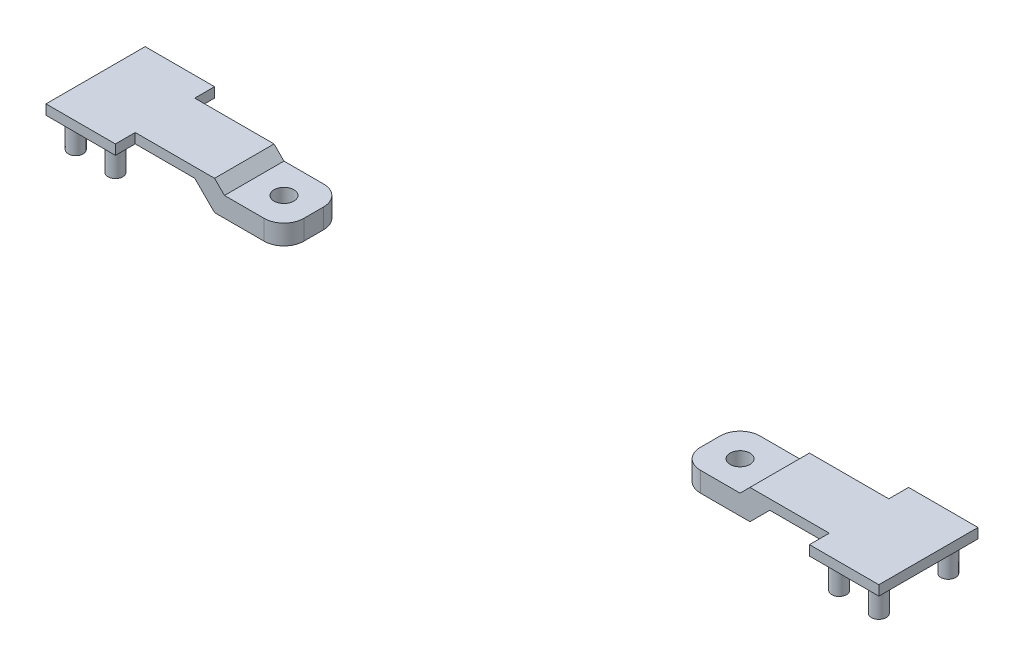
ISO-10303-21;
HEADER;
FILE_DESCRIPTION(('STEP AP214'),'2;1');
FILE_NAME('part.step','',(''),(''),'','','');
FILE_SCHEMA(('AUTOMOTIVE_DESIGN { 1 0 10303 214 1 1 1 1 }'));
ENDSEC;
DATA;
#1=APPLICATION_CONTEXT('core data for automotive mechanical design processes');
#2=APPLICATION_PROTOCOL_DEFINITION('international standard','automotive_design',2000,#1);
#3=PRODUCT_CONTEXT('',#1,'mechanical');
#4=PRODUCT('Part','Part','',(#3));
#5=PRODUCT_RELATED_PRODUCT_CATEGORY('part','',(#4));
#6=PRODUCT_DEFINITION_FORMATION('','',#4);
#7=PRODUCT_DEFINITION_CONTEXT('part definition',#1,'design');
#8=PRODUCT_DEFINITION('design','',#6,#7);
#9=PRODUCT_DEFINITION_SHAPE('','',#8);
#10=(LENGTH_UNIT() NAMED_UNIT(*) SI_UNIT(.MILLI.,.METRE.));
#11=(NAMED_UNIT(*) PLANE_ANGLE_UNIT() SI_UNIT($,.RADIAN.));
#12=(NAMED_UNIT(*) SI_UNIT($,.STERADIAN.) SOLID_ANGLE_UNIT());
#13=UNCERTAINTY_MEASURE_WITH_UNIT(LENGTH_MEASURE(1.E-05),#10,'distance_accuracy_value','');
#14=(GEOMETRIC_REPRESENTATION_CONTEXT(3) GLOBAL_UNCERTAINTY_ASSIGNED_CONTEXT((#13)) GLOBAL_UNIT_ASSIGNED_CONTEXT((#10,
#11,#12)) REPRESENTATION_CONTEXT('',''));
#15=CARTESIAN_POINT('',(0.,0.,0.));
#16=DIRECTION('',(0.,0.,1.));
#17=DIRECTION('',(1.,0.,0.));
#18=AXIS2_PLACEMENT_3D('',#15,#16,#17);
#19=CARTESIAN_POINT('',(-350.,10.,0.));
#20=DIRECTION('',(-1.,0.,0.));
#21=DIRECTION('',(0.,0.,1.));
#22=AXIS2_PLACEMENT_3D('',#19,#20,#21);
#23=PLANE('',#22);
#24=DIRECTION('',(0.,-1.,0.));
#25=VECTOR('',#24,1.);
#26=CARTESIAN_POINT('',(-350.,0.,30.));
#27=LINE('',#26,#25);
#28=CARTESIAN_POINT('',(-350.,10.,30.));
#29=VERTEX_POINT('',#28);
#30=CARTESIAN_POINT('',(-350.,0.,30.));
#31=VERTEX_POINT('',#30);
#32=EDGE_CURVE('E665',#29,#31,#27,.T.);
#33=ORIENTED_EDGE('',*,*,#32,.F.);
#34=DIRECTION('',(0.,0.,-1.));
#35=VECTOR('',#34,1.);
#36=CARTESIAN_POINT('',(-350.,10.,0.));
#37=LINE('',#36,#35);
#38=CARTESIAN_POINT('',(-350.,10.,50.0000000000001));
#39=VERTEX_POINT('',#38);
#40=EDGE_CURVE('E188',#39,#29,#37,.T.);
#41=ORIENTED_EDGE('',*,*,#40,.F.);
#42=DIRECTION('',(0.,-1.,0.));
#43=VECTOR('',#42,1.);
#44=CARTESIAN_POINT('',(-350.,10.,50.0000000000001));
#45=LINE('',#44,#43);
#46=CARTESIAN_POINT('',(-350.,0.,50.0000000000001));
#47=VERTEX_POINT('',#46);
#48=EDGE_CURVE('E231',#39,#47,#45,.T.);
#49=ORIENTED_EDGE('',*,*,#48,.T.);
#50=DIRECTION('',(0.,0.,-1.));
#51=VECTOR('',#50,1.);
#52=CARTESIAN_POINT('',(-350.,0.,0.));
#53=LINE('',#52,#51);
#54=EDGE_CURVE('E213',#47,#31,#53,.T.);
#55=ORIENTED_EDGE('',*,*,#54,.T.);
#56=EDGE_LOOP('',(#33,#41,#49,#55));
#57=FACE_BOUND('',#56,.T.);
#58=ADVANCED_FACE('F55',(#57),#23,.F.);
#59=CARTESIAN_POINT('',(0.,10.,50.0000000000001));
#60=DIRECTION('',(0.,0.,1.));
#61=DIRECTION('',(1.,0.,0.));
#62=AXIS2_PLACEMENT_3D('',#59,#60,#61);
#63=PLANE('',#62);
#64=DIRECTION('',(-1.,0.,0.));
#65=VECTOR('',#64,1.);
#66=CARTESIAN_POINT('',(0.,0.,50.0000000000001));
#67=LINE('',#66,#65);
#68=CARTESIAN_POINT('',(-420.,0.,50.0000000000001));
#69=VERTEX_POINT('',#68);
#70=EDGE_CURVE('E207',#47,#69,#67,.T.);
#71=ORIENTED_EDGE('',*,*,#70,.F.);
#72=ORIENTED_EDGE('',*,*,#48,.F.);
#73=DIRECTION('',(-1.,0.,0.));
#74=VECTOR('',#73,1.);
#75=CARTESIAN_POINT('',(0.,10.,50.0000000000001));
#76=LINE('',#75,#74);
#77=CARTESIAN_POINT('',(-420.,10.,50.0000000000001));
#78=VERTEX_POINT('',#77);
#79=EDGE_CURVE('E189',#39,#78,#76,.T.);
#80=ORIENTED_EDGE('',*,*,#79,.T.);
#81=DIRECTION('',(0.,-1.,0.));
#82=VECTOR('',#81,1.);
#83=CARTESIAN_POINT('',(-420.,10.,50.0000000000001));
#84=LINE('',#83,#82);
#85=EDGE_CURVE('E206',#78,#69,#84,.T.);
#86=ORIENTED_EDGE('',*,*,#85,.T.);
#87=EDGE_LOOP('',(#71,#72,#80,#86));
#88=FACE_BOUND('',#87,.T.);
#89=ADVANCED_FACE('F348',(#88),#63,.T.);
#90=CARTESIAN_POINT('',(-350.,10.,-30.));
#91=VERTEX_POINT('',#90);
#92=CARTESIAN_POINT('',(-350.,10.,-49.9999999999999));
#93=VERTEX_POINT('',#92);
#94=EDGE_CURVE('E163',#91,#93,#37,.T.);
#95=ORIENTED_EDGE('',*,*,#94,.F.);
#96=DIRECTION('',(0.,-1.,0.));
#97=VECTOR('',#96,1.);
#98=CARTESIAN_POINT('',(-350.,0.,-30.));
#99=LINE('',#98,#97);
#100=CARTESIAN_POINT('',(-350.,0.,-30.));
#101=VERTEX_POINT('',#100);
#102=EDGE_CURVE('E170',#91,#101,#99,.T.);
#103=ORIENTED_EDGE('',*,*,#102,.T.);
#104=CARTESIAN_POINT('',(-350.,0.,-49.9999999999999));
#105=VERTEX_POINT('',#104);
#106=EDGE_CURVE('E211',#101,#105,#53,.T.);
#107=ORIENTED_EDGE('',*,*,#106,.T.);
#108=DIRECTION('',(0.,-1.,0.));
#109=VECTOR('',#108,1.);
#110=CARTESIAN_POINT('',(-350.,10.,-49.9999999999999));
#111=LINE('',#110,#109);
#112=EDGE_CURVE('E185',#93,#105,#111,.T.);
#113=ORIENTED_EDGE('',*,*,#112,.F.);
#114=EDGE_LOOP('',(#95,#103,#107,#113));
#115=FACE_BOUND('',#114,.T.);
#116=ADVANCED_FACE('F183',(#115),#23,.F.);
#117=CARTESIAN_POINT('',(0.,10.,-49.9999999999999));
#118=DIRECTION('',(0.,0.,1.));
#119=DIRECTION('',(1.,0.,0.));
#120=AXIS2_PLACEMENT_3D('',#117,#118,#119);
#121=PLANE('',#120);
#122=DIRECTION('',(-1.,0.,0.));
#123=VECTOR('',#122,1.);
#124=CARTESIAN_POINT('',(0.,0.,-49.9999999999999));
#125=LINE('',#124,#123);
#126=CARTESIAN_POINT('',(-420.,0.,-49.9999999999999));
#127=VERTEX_POINT('',#126);
#128=EDGE_CURVE('E217',#105,#127,#125,.T.);
#129=ORIENTED_EDGE('',*,*,#128,.T.);
#130=DIRECTION('',(0.,-1.,0.));
#131=VECTOR('',#130,1.);
#132=CARTESIAN_POINT('',(-420.,10.,-49.9999999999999));
#133=LINE('',#132,#131);
#134=CARTESIAN_POINT('',(-420.,10.,-49.9999999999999));
#135=VERTEX_POINT('',#134);
#136=EDGE_CURVE('E226',#135,#127,#133,.T.);
#137=ORIENTED_EDGE('',*,*,#136,.F.);
#138=DIRECTION('',(-1.,0.,0.));
#139=VECTOR('',#138,1.);
#140=CARTESIAN_POINT('',(0.,10.,-49.9999999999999));
#141=LINE('',#140,#139);
#142=EDGE_CURVE('E194',#93,#135,#141,.T.);
#143=ORIENTED_EDGE('',*,*,#142,.F.);
#144=ORIENTED_EDGE('',*,*,#112,.T.);
#145=EDGE_LOOP('',(#129,#137,#143,#144));
#146=FACE_BOUND('',#145,.T.);
#147=ADVANCED_FACE('F359',(#146),#121,.F.);
#148=CARTESIAN_POINT('',(-420.,10.,0.));
#149=DIRECTION('',(-1.,0.,0.));
#150=DIRECTION('',(0.,0.,1.));
#151=AXIS2_PLACEMENT_3D('',#148,#149,#150);
#152=PLANE('',#151);
#153=DIRECTION('',(0.,0.,-1.));
#154=VECTOR('',#153,1.);
#155=CARTESIAN_POINT('',(-420.,0.,0.));
#156=LINE('',#155,#154);
#157=EDGE_CURVE('E196',#69,#127,#156,.T.);
#158=ORIENTED_EDGE('',*,*,#157,.F.);
#159=ORIENTED_EDGE('',*,*,#85,.F.);
#160=DIRECTION('',(0.,0.,-1.));
#161=VECTOR('',#160,1.);
#162=CARTESIAN_POINT('',(-420.,10.,0.));
#163=LINE('',#162,#161);
#164=EDGE_CURVE('E202',#78,#135,#163,.T.);
#165=ORIENTED_EDGE('',*,*,#164,.T.);
#166=ORIENTED_EDGE('',*,*,#136,.T.);
#167=EDGE_LOOP('',(#158,#159,#165,#166));
#168=FACE_BOUND('',#167,.T.);
#169=ADVANCED_FACE('F363',(#168),#152,.T.);
#170=CARTESIAN_POINT('',(0.,10.,0.));
#171=DIRECTION('',(0.,1.,0.));
#172=DIRECTION('',(0.,0.,1.));
#173=AXIS2_PLACEMENT_3D('',#170,#171,#172);
#174=PLANE('',#173);
#175=ORIENTED_EDGE('',*,*,#79,.F.);
#176=ORIENTED_EDGE('',*,*,#40,.T.);
#177=DIRECTION('',(1.,0.,0.));
#178=VECTOR('',#177,1.);
#179=CARTESIAN_POINT('',(0.,10.,30.));
#180=LINE('',#179,#178);
#181=CARTESIAN_POINT('',(-270.,10.,30.));
#182=VERTEX_POINT('',#181);
#183=EDGE_CURVE('E239',#29,#182,#180,.T.);
#184=ORIENTED_EDGE('',*,*,#183,.T.);
#185=DIRECTION('',(0.,0.,1.));
#186=VECTOR('',#185,1.);
#187=CARTESIAN_POINT('',(-270.,10.,-30.));
#188=LINE('',#187,#186);
#189=CARTESIAN_POINT('',(-270.,10.,-30.));
#190=VERTEX_POINT('',#189);
#191=EDGE_CURVE('E167',#190,#182,#188,.T.);
#192=ORIENTED_EDGE('',*,*,#191,.F.);
#193=DIRECTION('',(1.,0.,0.));
#194=VECTOR('',#193,1.);
#195=CARTESIAN_POINT('',(0.,10.,-30.));
#196=LINE('',#195,#194);
#197=EDGE_CURVE('E158',#91,#190,#196,.T.);
#198=ORIENTED_EDGE('',*,*,#197,.F.);
#199=ORIENTED_EDGE('',*,*,#94,.T.);
#200=ORIENTED_EDGE('',*,*,#142,.T.);
#201=ORIENTED_EDGE('',*,*,#164,.F.);
#202=EDGE_LOOP('',(#175,#176,#184,#192,#198,#199,#200,#201));
#203=FACE_BOUND('',#202,.T.);
#204=ADVANCED_FACE('F161',(#203),#174,.T.);
#205=CARTESIAN_POINT('',(0.,0.,0.));
#206=DIRECTION('',(0.,1.,0.));
#207=DIRECTION('',(0.,0.,1.));
#208=AXIS2_PLACEMENT_3D('',#205,#206,#207);
#209=PLANE('',#208);
#210=CARTESIAN_POINT('',(-405.,0.,-35.));
#211=DIRECTION('',(0.,1.,0.));
#212=DIRECTION('',(0.,0.,1.));
#213=AXIS2_PLACEMENT_3D('',#210,#211,#212);
#214=CIRCLE('',#213,7.50000000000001);
#215=CARTESIAN_POINT('',(-405.,0.,-27.4999999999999));
#216=VERTEX_POINT('',#215);
#217=EDGE_CURVE('E303',#216,#216,#214,.T.);
#218=ORIENTED_EDGE('',*,*,#217,.T.);
#219=EDGE_LOOP('',(#218));
#220=FACE_BOUND('',#219,.T.);
#221=CARTESIAN_POINT('',(-365.,0.,-35.));
#222=DIRECTION('',(0.,1.,0.));
#223=DIRECTION('',(0.,0.,1.));
#224=AXIS2_PLACEMENT_3D('',#221,#222,#223);
#225=CIRCLE('',#224,7.50000000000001);
#226=CARTESIAN_POINT('',(-365.,0.,-27.5));
#227=VERTEX_POINT('',#226);
#228=EDGE_CURVE('E302',#227,#227,#225,.T.);
#229=ORIENTED_EDGE('',*,*,#228,.T.);
#230=EDGE_LOOP('',(#229));
#231=FACE_BOUND('',#230,.T.);
#232=CARTESIAN_POINT('',(-365.,0.,35.));
#233=DIRECTION('',(0.,1.,0.));
#234=DIRECTION('',(0.,0.,1.));
#235=AXIS2_PLACEMENT_3D('',#232,#233,#234);
#236=CIRCLE('',#235,7.50000000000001);
#237=CARTESIAN_POINT('',(-365.,0.,42.5000000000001));
#238=VERTEX_POINT('',#237);
#239=EDGE_CURVE('E311',#238,#238,#236,.T.);
#240=ORIENTED_EDGE('',*,*,#239,.T.);
#241=EDGE_LOOP('',(#240));
#242=FACE_BOUND('',#241,.T.);
#243=CARTESIAN_POINT('',(-405.,0.,35.));
#244=DIRECTION('',(0.,1.,0.));
#245=DIRECTION('',(0.,0.,1.));
#246=AXIS2_PLACEMENT_3D('',#243,#244,#245);
#247=CIRCLE('',#246,7.50000000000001);
#248=CARTESIAN_POINT('',(-405.,0.,42.5000000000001));
#249=VERTEX_POINT('',#248);
#250=EDGE_CURVE('E319',#249,#249,#247,.T.);
#251=ORIENTED_EDGE('',*,*,#250,.T.);
#252=EDGE_LOOP('',(#251));
#253=FACE_BOUND('',#252,.T.);
#254=ORIENTED_EDGE('',*,*,#70,.T.);
#255=ORIENTED_EDGE('',*,*,#157,.T.);
#256=ORIENTED_EDGE('',*,*,#128,.F.);
#257=ORIENTED_EDGE('',*,*,#106,.F.);
#258=DIRECTION('',(1.,0.,0.));
#259=VECTOR('',#258,1.);
#260=CARTESIAN_POINT('',(0.,0.,-30.));
#261=LINE('',#260,#259);
#262=CARTESIAN_POINT('',(-290.,0.,-30.));
#263=VERTEX_POINT('',#262);
#264=EDGE_CURVE('E178',#101,#263,#261,.T.);
#265=ORIENTED_EDGE('',*,*,#264,.T.);
#266=DIRECTION('',(0.,0.,1.));
#267=VECTOR('',#266,1.);
#268=CARTESIAN_POINT('',(-290.,0.,-30.));
#269=LINE('',#268,#267);
#270=CARTESIAN_POINT('',(-290.,0.,30.));
#271=VERTEX_POINT('',#270);
#272=EDGE_CURVE('E292',#263,#271,#269,.T.);
#273=ORIENTED_EDGE('',*,*,#272,.T.);
#274=DIRECTION('',(1.,0.,0.));
#275=VECTOR('',#274,1.);
#276=CARTESIAN_POINT('',(0.,0.,30.));
#277=LINE('',#276,#275);
#278=EDGE_CURVE('E654',#31,#271,#277,.T.);
#279=ORIENTED_EDGE('',*,*,#278,.F.);
#280=ORIENTED_EDGE('',*,*,#54,.F.);
#281=EDGE_LOOP('',(#254,#255,#256,#257,#265,#273,#279,#280));
#282=FACE_BOUND('',#281,.T.);
#283=ADVANCED_FACE('F329',(#220,#231,#242,#253,#282),#209,.F.);
#284=CARTESIAN_POINT('',(-405.,-30.,35.));
#285=DIRECTION('',(0.,1.,0.));
#286=DIRECTION('',(0.,0.,1.));
#287=AXIS2_PLACEMENT_3D('',#284,#285,#286);
#288=CYLINDRICAL_SURFACE('',#287,7.50000000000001);
#289=CARTESIAN_POINT('',(-405.,-30.,35.));
#290=DIRECTION('',(0.,1.,0.));
#291=DIRECTION('',(0.,0.,1.));
#292=AXIS2_PLACEMENT_3D('',#289,#290,#291);
#293=CIRCLE('',#292,7.50000000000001);
#294=CARTESIAN_POINT('',(-405.,-30.,42.5000000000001));
#295=VERTEX_POINT('',#294);
#296=EDGE_CURVE('E212',#295,#295,#293,.T.);
#297=ORIENTED_EDGE('',*,*,#296,.T.);
#298=EDGE_LOOP('',(#297));
#299=FACE_BOUND('',#298,.T.);
#300=ORIENTED_EDGE('',*,*,#250,.F.);
#301=EDGE_LOOP('',(#300));
#302=FACE_BOUND('',#301,.T.);
#303=ADVANCED_FACE('F332',(#299,#302),#288,.T.);
#304=CARTESIAN_POINT('',(0.,-30.,0.));
#305=DIRECTION('',(0.,1.,0.));
#306=DIRECTION('',(0.,0.,1.));
#307=AXIS2_PLACEMENT_3D('',#304,#305,#306);
#308=PLANE('',#307);
#309=ORIENTED_EDGE('',*,*,#296,.F.);
#310=EDGE_LOOP('',(#309));
#311=FACE_BOUND('',#310,.T.);
#312=ADVANCED_FACE('F334',(#311),#308,.F.);
#313=CARTESIAN_POINT('',(-365.,-30.,35.));
#314=DIRECTION('',(0.,1.,0.));
#315=DIRECTION('',(0.,0.,1.));
#316=AXIS2_PLACEMENT_3D('',#313,#314,#315);
#317=CYLINDRICAL_SURFACE('',#316,7.50000000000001);
#318=CARTESIAN_POINT('',(-365.,-30.,35.));
#319=DIRECTION('',(0.,1.,0.));
#320=DIRECTION('',(0.,0.,1.));
#321=AXIS2_PLACEMENT_3D('',#318,#319,#320);
#322=CIRCLE('',#321,7.50000000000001);
#323=CARTESIAN_POINT('',(-365.,-30.,42.5000000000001));
#324=VERTEX_POINT('',#323);
#325=EDGE_CURVE('E315',#324,#324,#322,.T.);
#326=ORIENTED_EDGE('',*,*,#325,.T.);
#327=EDGE_LOOP('',(#326));
#328=FACE_BOUND('',#327,.T.);
#329=ORIENTED_EDGE('',*,*,#239,.F.);
#330=EDGE_LOOP('',(#329));
#331=FACE_BOUND('',#330,.T.);
#332=ADVANCED_FACE('F341',(#328,#331),#317,.T.);
#333=CARTESIAN_POINT('',(0.,-30.,0.));
#334=DIRECTION('',(0.,1.,0.));
#335=DIRECTION('',(0.,0.,1.));
#336=AXIS2_PLACEMENT_3D('',#333,#334,#335);
#337=PLANE('',#336);
#338=ORIENTED_EDGE('',*,*,#325,.F.);
#339=EDGE_LOOP('',(#338));
#340=FACE_BOUND('',#339,.T.);
#341=ADVANCED_FACE('F533',(#340),#337,.F.);
#342=CARTESIAN_POINT('',(-365.,-30.,-35.));
#343=DIRECTION('',(0.,1.,0.));
#344=DIRECTION('',(0.,0.,1.));
#345=AXIS2_PLACEMENT_3D('',#342,#343,#344);
#346=CYLINDRICAL_SURFACE('',#345,7.50000000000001);
#347=CARTESIAN_POINT('',(-365.,-30.,-35.));
#348=DIRECTION('',(0.,1.,0.));
#349=DIRECTION('',(0.,0.,1.));
#350=AXIS2_PLACEMENT_3D('',#347,#348,#349);
#351=CIRCLE('',#350,7.50000000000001);
#352=CARTESIAN_POINT('',(-365.,-30.,-27.5));
#353=VERTEX_POINT('',#352);
#354=EDGE_CURVE('E307',#353,#353,#351,.T.);
#355=ORIENTED_EDGE('',*,*,#354,.T.);
#356=EDGE_LOOP('',(#355));
#357=FACE_BOUND('',#356,.T.);
#358=ORIENTED_EDGE('',*,*,#228,.F.);
#359=EDGE_LOOP('',(#358));
#360=FACE_BOUND('',#359,.T.);
#361=ADVANCED_FACE('F524',(#357,#360),#346,.T.);
#362=CARTESIAN_POINT('',(0.,-30.,0.));
#363=DIRECTION('',(0.,1.,0.));
#364=DIRECTION('',(0.,0.,1.));
#365=AXIS2_PLACEMENT_3D('',#362,#363,#364);
#366=PLANE('',#365);
#367=ORIENTED_EDGE('',*,*,#354,.F.);
#368=EDGE_LOOP('',(#367));
#369=FACE_BOUND('',#368,.T.);
#370=ADVANCED_FACE('F513',(#369),#366,.F.);
#371=CARTESIAN_POINT('',(-405.,-30.,-35.));
#372=DIRECTION('',(0.,1.,0.));
#373=DIRECTION('',(0.,0.,1.));
#374=AXIS2_PLACEMENT_3D('',#371,#372,#373);
#375=CYLINDRICAL_SURFACE('',#374,7.50000000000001);
#376=CARTESIAN_POINT('',(-405.,-30.,-35.));
#377=DIRECTION('',(0.,1.,0.));
#378=DIRECTION('',(0.,0.,1.));
#379=AXIS2_PLACEMENT_3D('',#376,#377,#378);
#380=CIRCLE('',#379,7.50000000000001);
#381=CARTESIAN_POINT('',(-405.,-30.,-27.4999999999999));
#382=VERTEX_POINT('',#381);
#383=EDGE_CURVE('E298',#382,#382,#380,.T.);
#384=ORIENTED_EDGE('',*,*,#383,.T.);
#385=EDGE_LOOP('',(#384));
#386=FACE_BOUND('',#385,.T.);
#387=ORIENTED_EDGE('',*,*,#217,.F.);
#388=EDGE_LOOP('',(#387));
#389=FACE_BOUND('',#388,.T.);
#390=ADVANCED_FACE('F504',(#386,#389),#375,.T.);
#391=CARTESIAN_POINT('',(0.,-30.,0.));
#392=DIRECTION('',(0.,1.,0.));
#393=DIRECTION('',(0.,0.,1.));
#394=AXIS2_PLACEMENT_3D('',#391,#392,#393);
#395=PLANE('',#394);
#396=ORIENTED_EDGE('',*,*,#383,.F.);
#397=EDGE_LOOP('',(#396));
#398=FACE_BOUND('',#397,.T.);
#399=ADVANCED_FACE('F390',(#398),#395,.F.);
#400=CARTESIAN_POINT('',(-130.000000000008,-130.,-30.));
#401=DIRECTION('',(-0.707106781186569,-0.707106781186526,0.));
#402=DIRECTION('',(0.707106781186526,-0.707106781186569,0.));
#403=AXIS2_PLACEMENT_3D('',#400,#401,#402);
#404=PLANE('',#403);
#405=DIRECTION('',(0.707106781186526,-0.707106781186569,0.));
#406=VECTOR('',#405,1.);
#407=CARTESIAN_POINT('',(-130.000000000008,-130.,30.));
#408=LINE('',#407,#406);
#409=CARTESIAN_POINT('',(-260.000000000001,0.,30.));
#410=VERTEX_POINT('',#409);
#411=EDGE_CURVE('E171',#182,#410,#408,.T.);
#412=ORIENTED_EDGE('',*,*,#411,.T.);
#413=DIRECTION('',(0.,0.,1.));
#414=VECTOR('',#413,1.);
#415=CARTESIAN_POINT('',(-260.000000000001,0.,-30.));
#416=LINE('',#415,#414);
#417=CARTESIAN_POINT('',(-260.000000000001,0.,-30.));
#418=VERTEX_POINT('',#417);
#419=EDGE_CURVE('E289',#418,#410,#416,.T.);
#420=ORIENTED_EDGE('',*,*,#419,.F.);
#421=DIRECTION('',(0.707106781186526,-0.707106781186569,0.));
#422=VECTOR('',#421,1.);
#423=CARTESIAN_POINT('',(-130.000000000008,-130.,-30.));
#424=LINE('',#423,#422);
#425=EDGE_CURVE('E269',#190,#418,#424,.T.);
#426=ORIENTED_EDGE('',*,*,#425,.F.);
#427=ORIENTED_EDGE('',*,*,#191,.T.);
#428=EDGE_LOOP('',(#412,#420,#426,#427));
#429=FACE_BOUND('',#428,.T.);
#430=ADVANCED_FACE('F386',(#429),#404,.F.);
#431=CARTESIAN_POINT('',(0.,-8.05355782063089E-12,-30.));
#432=DIRECTION('',(0.,-1.,0.));
#433=DIRECTION('',(1.,0.,0.));
#434=AXIS2_PLACEMENT_3D('',#431,#432,#433);
#435=PLANE('',#434);
#436=CARTESIAN_POINT('',(-230.,7.12430114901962E-12,0.));
#437=DIRECTION('',(0.,1.,0.));
#438=DIRECTION('',(-1.,0.,0.));
#439=AXIS2_PLACEMENT_3D('',#436,#437,#438);
#440=CIRCLE('',#439,10.);
#441=CARTESIAN_POINT('',(-240.,7.43405337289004E-12,0.));
#442=VERTEX_POINT('',#441);
#443=EDGE_CURVE('E240',#442,#442,#440,.T.);
#444=ORIENTED_EDGE('',*,*,#443,.F.);
#445=EDGE_LOOP('',(#444));
#446=FACE_BOUND('',#445,.T.);
#447=DIRECTION('',(0.,0.,1.));
#448=VECTOR('',#447,1.);
#449=CARTESIAN_POINT('',(-200.,-1.85851334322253E-12,-30.));
#450=LINE('',#449,#448);
#451=CARTESIAN_POINT('',(-200.,-1.85851334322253E-12,-10.));
#452=VERTEX_POINT('',#451);
#453=CARTESIAN_POINT('',(-200.,-1.85851334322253E-12,9.99999999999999));
#454=VERTEX_POINT('',#453);
#455=EDGE_CURVE('E264',#452,#454,#450,.T.);
#456=ORIENTED_EDGE('',*,*,#455,.F.);
#457=CARTESIAN_POINT('',(-220.,-1.23900889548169E-12,-10.));
#458=DIRECTION('',(0.,-1.,0.));
#459=DIRECTION('',(1.,0.,0.));
#460=AXIS2_PLACEMENT_3D('',#457,#458,#459);
#461=CIRCLE('',#460,20.);
#462=CARTESIAN_POINT('',(-220.,-1.23900889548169E-12,-30.));
#463=VERTEX_POINT('',#462);
#464=EDGE_CURVE('E64',#452,#463,#461,.F.);
#465=ORIENTED_EDGE('',*,*,#464,.T.);
#466=DIRECTION('',(1.,0.,0.));
#467=VECTOR('',#466,1.);
#468=CARTESIAN_POINT('',(0.,-8.05355782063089E-12,-30.));
#469=LINE('',#468,#467);
#470=EDGE_CURVE('E263',#418,#463,#469,.T.);
#471=ORIENTED_EDGE('',*,*,#470,.F.);
#472=ORIENTED_EDGE('',*,*,#419,.T.);
#473=DIRECTION('',(1.,0.,0.));
#474=VECTOR('',#473,1.);
#475=CARTESIAN_POINT('',(0.,-8.05355782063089E-12,30.));
#476=LINE('',#475,#474);
#477=CARTESIAN_POINT('',(-220.,-1.23900889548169E-12,30.));
#478=VERTEX_POINT('',#477);
#479=EDGE_CURVE('E649',#410,#478,#476,.T.);
#480=ORIENTED_EDGE('',*,*,#479,.T.);
#481=CARTESIAN_POINT('',(-220.,-1.23900889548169E-12,9.99999999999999));
#482=DIRECTION('',(0.,-1.,0.));
#483=DIRECTION('',(1.,0.,0.));
#484=AXIS2_PLACEMENT_3D('',#481,#482,#483);
#485=CIRCLE('',#484,20.);
#486=EDGE_CURVE('E76',#478,#454,#485,.F.);
#487=ORIENTED_EDGE('',*,*,#486,.T.);
#488=EDGE_LOOP('',(#456,#465,#471,#472,#480,#487));
#489=FACE_BOUND('',#488,.T.);
#490=ADVANCED_FACE('F261',(#446,#489),#435,.F.);
#491=CARTESIAN_POINT('',(-200.,0.,-30.));
#492=DIRECTION('',(-1.,0.,0.));
#493=DIRECTION('',(0.,0.,1.));
#494=AXIS2_PLACEMENT_3D('',#491,#492,#493);
#495=PLANE('',#494);
#496=DIRECTION('',(0.,0.,1.));
#497=VECTOR('',#496,1.);
#498=CARTESIAN_POINT('',(-200.,-20.0000000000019,-30.));
#499=LINE('',#498,#497);
#500=CARTESIAN_POINT('',(-200.,-20.0000000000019,-10.));
#501=VERTEX_POINT('',#500);
#502=CARTESIAN_POINT('',(-200.,-20.0000000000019,9.99999999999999));
#503=VERTEX_POINT('',#502);
#504=EDGE_CURVE('E279',#501,#503,#499,.T.);
#505=ORIENTED_EDGE('',*,*,#504,.F.);
#506=DIRECTION('',(0.,-1.,0.));
#507=VECTOR('',#506,1.);
#508=CARTESIAN_POINT('',(-200.,0.,-10.));
#509=LINE('',#508,#507);
#510=EDGE_CURVE('E254',#501,#452,#509,.F.);
#511=ORIENTED_EDGE('',*,*,#510,.T.);
#512=ORIENTED_EDGE('',*,*,#455,.T.);
#513=DIRECTION('',(0.,-1.,0.));
#514=VECTOR('',#513,1.);
#515=CARTESIAN_POINT('',(-200.,-20.0000000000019,9.99999999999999));
#516=LINE('',#515,#514);
#517=EDGE_CURVE('E250',#454,#503,#516,.T.);
#518=ORIENTED_EDGE('',*,*,#517,.T.);
#519=EDGE_LOOP('',(#505,#511,#512,#518));
#520=FACE_BOUND('',#519,.T.);
#521=ADVANCED_FACE('F282',(#520),#495,.F.);
#522=CARTESIAN_POINT('',(0.,-20.0000000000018,-30.));
#523=DIRECTION('',(0.,1.,0.));
#524=DIRECTION('',(-1.,0.,0.));
#525=AXIS2_PLACEMENT_3D('',#522,#523,#524);
#526=PLANE('',#525);
#527=CARTESIAN_POINT('',(-230.000000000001,-20.0000000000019,0.));
#528=DIRECTION('',(0.,1.,0.));
#529=DIRECTION('',(-1.,0.,0.));
#530=AXIS2_PLACEMENT_3D('',#527,#528,#529);
#531=CIRCLE('',#530,10.);
#532=CARTESIAN_POINT('',(-240.000000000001,-20.0000000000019,0.));
#533=VERTEX_POINT('',#532);
#534=EDGE_CURVE('E235',#533,#533,#531,.T.);
#535=ORIENTED_EDGE('',*,*,#534,.T.);
#536=EDGE_LOOP('',(#535));
#537=FACE_BOUND('',#536,.T.);
#538=DIRECTION('',(-1.,0.,0.));
#539=VECTOR('',#538,1.);
#540=CARTESIAN_POINT('',(0.,-20.0000000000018,-30.));
#541=LINE('',#540,#539);
#542=CARTESIAN_POINT('',(-220.,-20.0000000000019,-30.));
#543=VERTEX_POINT('',#542);
#544=CARTESIAN_POINT('',(-269.999999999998,-20.0000000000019,-30.));
#545=VERTEX_POINT('',#544);
#546=EDGE_CURVE('E272',#543,#545,#541,.T.);
#547=ORIENTED_EDGE('',*,*,#546,.F.);
#548=CARTESIAN_POINT('',(-220.,-20.0000000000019,-10.));
#549=DIRECTION('',(0.,1.,0.));
#550=DIRECTION('',(-1.,0.,0.));
#551=AXIS2_PLACEMENT_3D('',#548,#549,#550);
#552=CIRCLE('',#551,20.);
#553=EDGE_CURVE('E247',#543,#501,#552,.F.);
#554=ORIENTED_EDGE('',*,*,#553,.T.);
#555=ORIENTED_EDGE('',*,*,#504,.T.);
#556=CARTESIAN_POINT('',(-220.,-20.0000000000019,9.99999999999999));
#557=DIRECTION('',(0.,1.,0.));
#558=DIRECTION('',(-1.,0.,0.));
#559=AXIS2_PLACEMENT_3D('',#556,#557,#558);
#560=CIRCLE('',#559,20.);
#561=CARTESIAN_POINT('',(-220.,-20.0000000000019,30.));
#562=VERTEX_POINT('',#561);
#563=EDGE_CURVE('E244',#503,#562,#560,.F.);
#564=ORIENTED_EDGE('',*,*,#563,.T.);
#565=DIRECTION('',(-1.,0.,0.));
#566=VECTOR('',#565,1.);
#567=CARTESIAN_POINT('',(0.,-20.0000000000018,30.));
#568=LINE('',#567,#566);
#569=CARTESIAN_POINT('',(-269.999999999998,-20.0000000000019,30.));
#570=VERTEX_POINT('',#569);
#571=EDGE_CURVE('E643',#562,#570,#568,.T.);
#572=ORIENTED_EDGE('',*,*,#571,.T.);
#573=DIRECTION('',(0.,0.,1.));
#574=VECTOR('',#573,1.);
#575=CARTESIAN_POINT('',(-269.999999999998,-20.0000000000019,-30.));
#576=LINE('',#575,#574);
#577=EDGE_CURVE('E285',#545,#570,#576,.T.);
#578=ORIENTED_EDGE('',*,*,#577,.F.);
#579=EDGE_LOOP('',(#547,#554,#555,#564,#572,#578));
#580=FACE_BOUND('',#579,.T.);
#581=ADVANCED_FACE('F278',(#537,#580),#526,.F.);
#582=CARTESIAN_POINT('',(-145.,-145.,-30.));
#583=DIRECTION('',(-0.707106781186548,-0.707106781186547,0.));
#584=DIRECTION('',(0.707106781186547,-0.707106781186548,0.));
#585=AXIS2_PLACEMENT_3D('',#582,#583,#584);
#586=PLANE('',#585);
#587=DIRECTION('',(0.707106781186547,-0.707106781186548,0.));
#588=VECTOR('',#587,1.);
#589=CARTESIAN_POINT('',(-145.,-145.,30.));
#590=LINE('',#589,#588);
#591=EDGE_CURVE('E647',#271,#570,#590,.T.);
#592=ORIENTED_EDGE('',*,*,#591,.F.);
#593=ORIENTED_EDGE('',*,*,#272,.F.);
#594=DIRECTION('',(0.707106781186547,-0.707106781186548,0.));
#595=VECTOR('',#594,1.);
#596=CARTESIAN_POINT('',(-145.,-145.,-30.));
#597=LINE('',#596,#595);
#598=EDGE_CURVE('E674',#263,#545,#597,.T.);
#599=ORIENTED_EDGE('',*,*,#598,.T.);
#600=ORIENTED_EDGE('',*,*,#577,.T.);
#601=EDGE_LOOP('',(#592,#593,#599,#600));
#602=FACE_BOUND('',#601,.T.);
#603=ADVANCED_FACE('F400',(#602),#586,.T.);
#604=CARTESIAN_POINT('',(0.,0.,-30.));
#605=DIRECTION('',(0.,0.,1.));
#606=DIRECTION('',(1.,0.,0.));
#607=AXIS2_PLACEMENT_3D('',#604,#605,#606);
#608=PLANE('',#607);
#609=ORIENTED_EDGE('',*,*,#470,.T.);
#610=DIRECTION('',(0.,-1.,0.));
#611=VECTOR('',#610,1.);
#612=CARTESIAN_POINT('',(-220.,0.,-30.));
#613=LINE('',#612,#611);
#614=EDGE_CURVE('E234',#463,#543,#613,.T.);
#615=ORIENTED_EDGE('',*,*,#614,.T.);
#616=ORIENTED_EDGE('',*,*,#546,.T.);
#617=ORIENTED_EDGE('',*,*,#598,.F.);
#618=ORIENTED_EDGE('',*,*,#264,.F.);
#619=ORIENTED_EDGE('',*,*,#102,.F.);
#620=ORIENTED_EDGE('',*,*,#197,.T.);
#621=ORIENTED_EDGE('',*,*,#425,.T.);
#622=EDGE_LOOP('',(#609,#615,#616,#617,#618,#619,#620,#621));
#623=FACE_BOUND('',#622,.T.);
#624=ADVANCED_FACE('F175',(#623),#608,.F.);
#625=CARTESIAN_POINT('',(0.,0.,30.));
#626=DIRECTION('',(0.,0.,1.));
#627=DIRECTION('',(1.,0.,0.));
#628=AXIS2_PLACEMENT_3D('',#625,#626,#627);
#629=PLANE('',#628);
#630=ORIENTED_EDGE('',*,*,#571,.F.);
#631=DIRECTION('',(0.,-1.,0.));
#632=VECTOR('',#631,1.);
#633=CARTESIAN_POINT('',(-220.,-1.85851334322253E-12,30.));
#634=LINE('',#633,#632);
#635=EDGE_CURVE('E12',#562,#478,#634,.F.);
#636=ORIENTED_EDGE('',*,*,#635,.T.);
#637=ORIENTED_EDGE('',*,*,#479,.F.);
#638=ORIENTED_EDGE('',*,*,#411,.F.);
#639=ORIENTED_EDGE('',*,*,#183,.F.);
#640=ORIENTED_EDGE('',*,*,#32,.T.);
#641=ORIENTED_EDGE('',*,*,#278,.T.);
#642=ORIENTED_EDGE('',*,*,#591,.T.);
#643=EDGE_LOOP('',(#630,#636,#637,#638,#639,#640,#641,#642));
#644=FACE_BOUND('',#643,.T.);
#645=ADVANCED_FACE('F420',(#644),#629,.T.);
#646=CARTESIAN_POINT('',(-230.000000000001,-43.9999999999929,0.));
#647=DIRECTION('',(0.,1.,0.));
#648=DIRECTION('',(-1.,0.,0.));
#649=AXIS2_PLACEMENT_3D('',#646,#647,#648);
#650=CYLINDRICAL_SURFACE('',#649,10.);
#651=ORIENTED_EDGE('',*,*,#443,.T.);
#652=EDGE_LOOP('',(#651));
#653=FACE_BOUND('',#652,.T.);
#654=ORIENTED_EDGE('',*,*,#534,.F.);
#655=EDGE_LOOP('',(#654));
#656=FACE_BOUND('',#655,.T.);
#657=ADVANCED_FACE('F415',(#653,#656),#650,.F.);
#658=CARTESIAN_POINT('',(-220.,0.,-10.));
#659=DIRECTION('',(0.,-1.,0.));
#660=DIRECTION('',(0.,0.,-1.));
#661=AXIS2_PLACEMENT_3D('',#658,#659,#660);
#662=CYLINDRICAL_SURFACE('',#661,20.);
#663=ORIENTED_EDGE('',*,*,#464,.F.);
#664=ORIENTED_EDGE('',*,*,#510,.F.);
#665=ORIENTED_EDGE('',*,*,#553,.F.);
#666=ORIENTED_EDGE('',*,*,#614,.F.);
#667=EDGE_LOOP('',(#663,#664,#665,#666));
#668=FACE_BOUND('',#667,.T.);
#669=ADVANCED_FACE('F274',(#668),#662,.T.);
#670=CARTESIAN_POINT('',(-220.,0.,9.99999999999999));
#671=DIRECTION('',(0.,1.,0.));
#672=DIRECTION('',(0.,0.,1.));
#673=AXIS2_PLACEMENT_3D('',#670,#671,#672);
#674=CYLINDRICAL_SURFACE('',#673,20.);
#675=ORIENTED_EDGE('',*,*,#486,.F.);
#676=ORIENTED_EDGE('',*,*,#635,.F.);
#677=ORIENTED_EDGE('',*,*,#563,.F.);
#678=ORIENTED_EDGE('',*,*,#517,.F.);
#679=EDGE_LOOP('',(#675,#676,#677,#678));
#680=FACE_BOUND('',#679,.T.);
#681=ADVANCED_FACE('F57',(#680),#674,.T.);
#682=CLOSED_SHELL('',(#58,#89,#116,#147,#169,#204,#283,#303,#312,#332,#341,#361,#370,#390,#399,
#430,#490,#521,#581,#603,#624,#645,#657,#669,#681));
#683=MANIFOLD_SOLID_BREP('B2',#682);
#684=CARTESIAN_POINT('',(350.,10.,0.));
#685=DIRECTION('',(-1.,0.,0.));
#686=DIRECTION('',(0.,0.,1.));
#687=AXIS2_PLACEMENT_3D('',#684,#685,#686);
#688=PLANE('',#687);
#689=DIRECTION('',(0.,0.,-1.));
#690=VECTOR('',#689,1.);
#691=CARTESIAN_POINT('',(350.,10.,0.));
#692=LINE('',#691,#690);
#693=CARTESIAN_POINT('',(350.,10.,50.0000000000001));
#694=VERTEX_POINT('',#693);
#695=CARTESIAN_POINT('',(350.,10.,30.));
#696=VERTEX_POINT('',#695);
#697=EDGE_CURVE('E892',#694,#696,#692,.T.);
#698=ORIENTED_EDGE('',*,*,#697,.T.);
#699=DIRECTION('',(0.,-1.,0.));
#700=VECTOR('',#699,1.);
#701=CARTESIAN_POINT('',(350.,0.,30.));
#702=LINE('',#701,#700);
#703=CARTESIAN_POINT('',(350.,0.,30.));
#704=VERTEX_POINT('',#703);
#705=EDGE_CURVE('E838',#696,#704,#702,.T.);
#706=ORIENTED_EDGE('',*,*,#705,.T.);
#707=DIRECTION('',(0.,0.,-1.));
#708=VECTOR('',#707,1.);
#709=CARTESIAN_POINT('',(350.,0.,0.));
#710=LINE('',#709,#708);
#711=CARTESIAN_POINT('',(350.,0.,50.0000000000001));
#712=VERTEX_POINT('',#711);
#713=EDGE_CURVE('E903',#712,#704,#710,.T.);
#714=ORIENTED_EDGE('',*,*,#713,.F.);
#715=DIRECTION('',(0.,-1.,0.));
#716=VECTOR('',#715,1.);
#717=CARTESIAN_POINT('',(350.,10.,50.0000000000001));
#718=LINE('',#717,#716);
#719=EDGE_CURVE('E914',#694,#712,#718,.T.);
#720=ORIENTED_EDGE('',*,*,#719,.F.);
#721=EDGE_LOOP('',(#698,#706,#714,#720));
#722=FACE_BOUND('',#721,.T.);
#723=ADVANCED_FACE('F697',(#722),#688,.T.);
#724=CARTESIAN_POINT('',(0.,10.,-49.9999999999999));
#725=DIRECTION('',(0.,0.,1.));
#726=DIRECTION('',(1.,0.,0.));
#727=AXIS2_PLACEMENT_3D('',#724,#725,#726);
#728=PLANE('',#727);
#729=DIRECTION('',(-1.,0.,0.));
#730=VECTOR('',#729,1.);
#731=CARTESIAN_POINT('',(0.,0.,-49.9999999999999));
#732=LINE('',#731,#730);
#733=CARTESIAN_POINT('',(420.,0.,-49.9999999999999));
#734=VERTEX_POINT('',#733);
#735=CARTESIAN_POINT('',(350.,0.,-49.9999999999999));
#736=VERTEX_POINT('',#735);
#737=EDGE_CURVE('E886',#734,#736,#732,.T.);
#738=ORIENTED_EDGE('',*,*,#737,.T.);
#739=DIRECTION('',(0.,-1.,0.));
#740=VECTOR('',#739,1.);
#741=CARTESIAN_POINT('',(350.,10.,-49.9999999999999));
#742=LINE('',#741,#740);
#743=CARTESIAN_POINT('',(350.,10.,-49.9999999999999));
#744=VERTEX_POINT('',#743);
#745=EDGE_CURVE('E916',#744,#736,#742,.T.);
#746=ORIENTED_EDGE('',*,*,#745,.F.);
#747=DIRECTION('',(-1.,0.,0.));
#748=VECTOR('',#747,1.);
#749=CARTESIAN_POINT('',(0.,10.,-49.9999999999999));
#750=LINE('',#749,#748);
#751=CARTESIAN_POINT('',(420.,10.,-49.9999999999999));
#752=VERTEX_POINT('',#751);
#753=EDGE_CURVE('E889',#752,#744,#750,.T.);
#754=ORIENTED_EDGE('',*,*,#753,.F.);
#755=DIRECTION('',(0.,-1.,0.));
#756=VECTOR('',#755,1.);
#757=CARTESIAN_POINT('',(420.,10.,-49.9999999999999));
#758=LINE('',#757,#756);
#759=EDGE_CURVE('E899',#752,#734,#758,.T.);
#760=ORIENTED_EDGE('',*,*,#759,.T.);
#761=EDGE_LOOP('',(#738,#746,#754,#760));
#762=FACE_BOUND('',#761,.T.);
#763=ADVANCED_FACE('F960',(#762),#728,.F.);
#764=DIRECTION('',(0.,-1.,0.));
#765=VECTOR('',#764,1.);
#766=CARTESIAN_POINT('',(350.,0.,-30.));
#767=LINE('',#766,#765);
#768=CARTESIAN_POINT('',(350.,10.,-30.));
#769=VERTEX_POINT('',#768);
#770=CARTESIAN_POINT('',(350.,0.,-30.));
#771=VERTEX_POINT('',#770);
#772=EDGE_CURVE('E825',#769,#771,#767,.T.);
#773=ORIENTED_EDGE('',*,*,#772,.F.);
#774=EDGE_CURVE('E824',#769,#744,#692,.T.);
#775=ORIENTED_EDGE('',*,*,#774,.T.);
#776=ORIENTED_EDGE('',*,*,#745,.T.);
#777=EDGE_CURVE('E902',#771,#736,#710,.T.);
#778=ORIENTED_EDGE('',*,*,#777,.F.);
#779=EDGE_LOOP('',(#773,#775,#776,#778));
#780=FACE_BOUND('',#779,.T.);
#781=ADVANCED_FACE('F963',(#780),#688,.T.);
#782=CARTESIAN_POINT('',(0.,10.,50.0000000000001));
#783=DIRECTION('',(0.,0.,1.));
#784=DIRECTION('',(1.,0.,0.));
#785=AXIS2_PLACEMENT_3D('',#782,#783,#784);
#786=PLANE('',#785);
#787=DIRECTION('',(-1.,0.,0.));
#788=VECTOR('',#787,1.);
#789=CARTESIAN_POINT('',(0.,0.,50.0000000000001));
#790=LINE('',#789,#788);
#791=CARTESIAN_POINT('',(420.,0.,50.0000000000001));
#792=VERTEX_POINT('',#791);
#793=EDGE_CURVE('E906',#792,#712,#790,.T.);
#794=ORIENTED_EDGE('',*,*,#793,.F.);
#795=DIRECTION('',(0.,-1.,0.));
#796=VECTOR('',#795,1.);
#797=CARTESIAN_POINT('',(420.,10.,50.0000000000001));
#798=LINE('',#797,#796);
#799=CARTESIAN_POINT('',(420.,10.,50.0000000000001));
#800=VERTEX_POINT('',#799);
#801=EDGE_CURVE('E912',#800,#792,#798,.T.);
#802=ORIENTED_EDGE('',*,*,#801,.F.);
#803=DIRECTION('',(-1.,0.,0.));
#804=VECTOR('',#803,1.);
#805=CARTESIAN_POINT('',(0.,10.,50.0000000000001));
#806=LINE('',#805,#804);
#807=EDGE_CURVE('E894',#800,#694,#806,.T.);
#808=ORIENTED_EDGE('',*,*,#807,.T.);
#809=ORIENTED_EDGE('',*,*,#719,.T.);
#810=EDGE_LOOP('',(#794,#802,#808,#809));
#811=FACE_BOUND('',#810,.T.);
#812=ADVANCED_FACE('F971',(#811),#786,.T.);
#813=CARTESIAN_POINT('',(420.,10.,0.));
#814=DIRECTION('',(-1.,0.,0.));
#815=DIRECTION('',(0.,0.,1.));
#816=AXIS2_PLACEMENT_3D('',#813,#814,#815);
#817=PLANE('',#816);
#818=DIRECTION('',(0.,0.,-1.));
#819=VECTOR('',#818,1.);
#820=CARTESIAN_POINT('',(420.,0.,0.));
#821=LINE('',#820,#819);
#822=EDGE_CURVE('E891',#792,#734,#821,.T.);
#823=ORIENTED_EDGE('',*,*,#822,.T.);
#824=ORIENTED_EDGE('',*,*,#759,.F.);
#825=DIRECTION('',(0.,0.,-1.));
#826=VECTOR('',#825,1.);
#827=CARTESIAN_POINT('',(420.,10.,0.));
#828=LINE('',#827,#826);
#829=EDGE_CURVE('E897',#800,#752,#828,.T.);
#830=ORIENTED_EDGE('',*,*,#829,.F.);
#831=ORIENTED_EDGE('',*,*,#801,.T.);
#832=EDGE_LOOP('',(#823,#824,#830,#831));
#833=FACE_BOUND('',#832,.T.);
#834=ADVANCED_FACE('F976',(#833),#817,.F.);
#835=CARTESIAN_POINT('',(0.,10.,0.));
#836=DIRECTION('',(0.,1.,0.));
#837=DIRECTION('',(0.,0.,1.));
#838=AXIS2_PLACEMENT_3D('',#835,#836,#837);
#839=PLANE('',#838);
#840=ORIENTED_EDGE('',*,*,#753,.T.);
#841=ORIENTED_EDGE('',*,*,#774,.F.);
#842=DIRECTION('',(-1.,0.,0.));
#843=VECTOR('',#842,1.);
#844=CARTESIAN_POINT('',(0.,9.99999999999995,-30.));
#845=LINE('',#844,#843);
#846=CARTESIAN_POINT('',(270.,9.99999999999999,-30.));
#847=VERTEX_POINT('',#846);
#848=EDGE_CURVE('E818',#769,#847,#845,.T.);
#849=ORIENTED_EDGE('',*,*,#848,.T.);
#850=DIRECTION('',(0.,0.,1.));
#851=VECTOR('',#850,1.);
#852=CARTESIAN_POINT('',(270.,9.99999999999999,-30.));
#853=LINE('',#852,#851);
#854=CARTESIAN_POINT('',(270.,9.99999999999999,30.));
#855=VERTEX_POINT('',#854);
#856=EDGE_CURVE('E802',#847,#855,#853,.T.);
#857=ORIENTED_EDGE('',*,*,#856,.T.);
#858=DIRECTION('',(-1.,0.,0.));
#859=VECTOR('',#858,1.);
#860=CARTESIAN_POINT('',(0.,9.99999999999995,30.));
#861=LINE('',#860,#859);
#862=EDGE_CURVE('E840',#696,#855,#861,.T.);
#863=ORIENTED_EDGE('',*,*,#862,.F.);
#864=ORIENTED_EDGE('',*,*,#697,.F.);
#865=ORIENTED_EDGE('',*,*,#807,.F.);
#866=ORIENTED_EDGE('',*,*,#829,.T.);
#867=EDGE_LOOP('',(#840,#841,#849,#857,#863,#864,#865,#866));
#868=FACE_BOUND('',#867,.T.);
#869=ADVANCED_FACE('F823',(#868),#839,.T.);
#870=CARTESIAN_POINT('',(0.,0.,0.));
#871=DIRECTION('',(0.,1.,0.));
#872=DIRECTION('',(0.,0.,1.));
#873=AXIS2_PLACEMENT_3D('',#870,#871,#872);
#874=PLANE('',#873);
#875=CARTESIAN_POINT('',(365.,0.,-35.));
#876=DIRECTION('',(0.,1.,0.));
#877=DIRECTION('',(0.,0.,1.));
#878=AXIS2_PLACEMENT_3D('',#875,#876,#877);
#879=CIRCLE('',#878,7.50000000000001);
#880=CARTESIAN_POINT('',(365.,0.,-27.5));
#881=VERTEX_POINT('',#880);
#882=EDGE_CURVE('E855',#881,#881,#879,.T.);
#883=ORIENTED_EDGE('',*,*,#882,.T.);
#884=EDGE_LOOP('',(#883));
#885=FACE_BOUND('',#884,.T.);
#886=CARTESIAN_POINT('',(405.,0.,-35.));
#887=DIRECTION('',(0.,1.,0.));
#888=DIRECTION('',(0.,0.,1.));
#889=AXIS2_PLACEMENT_3D('',#886,#887,#888);
#890=CIRCLE('',#889,7.50000000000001);
#891=CARTESIAN_POINT('',(405.,0.,-27.5));
#892=VERTEX_POINT('',#891);
#893=EDGE_CURVE('E868',#892,#892,#890,.T.);
#894=ORIENTED_EDGE('',*,*,#893,.T.);
#895=EDGE_LOOP('',(#894));
#896=FACE_BOUND('',#895,.T.);
#897=CARTESIAN_POINT('',(405.,0.,35.));
#898=DIRECTION('',(0.,1.,0.));
#899=DIRECTION('',(0.,0.,1.));
#900=AXIS2_PLACEMENT_3D('',#897,#898,#899);
#901=CIRCLE('',#900,7.50000000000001);
#902=CARTESIAN_POINT('',(405.,0.,42.5));
#903=VERTEX_POINT('',#902);
#904=EDGE_CURVE('E874',#903,#903,#901,.T.);
#905=ORIENTED_EDGE('',*,*,#904,.T.);
#906=EDGE_LOOP('',(#905));
#907=FACE_BOUND('',#906,.T.);
#908=CARTESIAN_POINT('',(365.,0.,35.));
#909=DIRECTION('',(0.,1.,0.));
#910=DIRECTION('',(0.,0.,1.));
#911=AXIS2_PLACEMENT_3D('',#908,#909,#910);
#912=CIRCLE('',#911,7.50000000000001);
#913=CARTESIAN_POINT('',(365.,0.,42.5));
#914=VERTEX_POINT('',#913);
#915=EDGE_CURVE('E880',#914,#914,#912,.T.);
#916=ORIENTED_EDGE('',*,*,#915,.T.);
#917=EDGE_LOOP('',(#916));
#918=FACE_BOUND('',#917,.T.);
#919=ORIENTED_EDGE('',*,*,#737,.F.);
#920=ORIENTED_EDGE('',*,*,#822,.F.);
#921=ORIENTED_EDGE('',*,*,#793,.T.);
#922=ORIENTED_EDGE('',*,*,#713,.T.);
#923=DIRECTION('',(-1.,0.,0.));
#924=VECTOR('',#923,1.);
#925=CARTESIAN_POINT('',(0.,0.,30.));
#926=LINE('',#925,#924);
#927=CARTESIAN_POINT('',(290.,0.,30.));
#928=VERTEX_POINT('',#927);
#929=EDGE_CURVE('E827',#704,#928,#926,.T.);
#930=ORIENTED_EDGE('',*,*,#929,.T.);
#931=DIRECTION('',(0.,0.,1.));
#932=VECTOR('',#931,1.);
#933=CARTESIAN_POINT('',(290.,0.,-30.));
#934=LINE('',#933,#932);
#935=CARTESIAN_POINT('',(290.,0.,-30.));
#936=VERTEX_POINT('',#935);
#937=EDGE_CURVE('E852',#936,#928,#934,.T.);
#938=ORIENTED_EDGE('',*,*,#937,.F.);
#939=DIRECTION('',(-1.,0.,0.));
#940=VECTOR('',#939,1.);
#941=CARTESIAN_POINT('',(0.,0.,-30.));
#942=LINE('',#941,#940);
#943=EDGE_CURVE('E813',#771,#936,#942,.T.);
#944=ORIENTED_EDGE('',*,*,#943,.F.);
#945=ORIENTED_EDGE('',*,*,#777,.T.);
#946=EDGE_LOOP('',(#919,#920,#921,#922,#930,#938,#944,#945));
#947=FACE_BOUND('',#946,.T.);
#948=ADVANCED_FACE('F981',(#885,#896,#907,#918,#947),#874,.F.);
#949=CARTESIAN_POINT('',(365.,-30.,35.));
#950=DIRECTION('',(0.,1.,0.));
#951=DIRECTION('',(0.,0.,1.));
#952=AXIS2_PLACEMENT_3D('',#949,#950,#951);
#953=CYLINDRICAL_SURFACE('',#952,7.50000000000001);
#954=CARTESIAN_POINT('',(365.,-30.,35.));
#955=DIRECTION('',(0.,1.,0.));
#956=DIRECTION('',(0.,0.,1.));
#957=AXIS2_PLACEMENT_3D('',#954,#955,#956);
#958=CIRCLE('',#957,7.50000000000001);
#959=CARTESIAN_POINT('',(365.,-30.,42.5));
#960=VERTEX_POINT('',#959);
#961=EDGE_CURVE('E883',#960,#960,#958,.T.);
#962=ORIENTED_EDGE('',*,*,#961,.T.);
#963=EDGE_LOOP('',(#962));
#964=FACE_BOUND('',#963,.T.);
#965=ORIENTED_EDGE('',*,*,#915,.F.);
#966=EDGE_LOOP('',(#965));
#967=FACE_BOUND('',#966,.T.);
#968=ADVANCED_FACE('F1000',(#964,#967),#953,.T.);
#969=CARTESIAN_POINT('',(0.,-30.,0.));
#970=DIRECTION('',(0.,1.,0.));
#971=DIRECTION('',(0.,0.,1.));
#972=AXIS2_PLACEMENT_3D('',#969,#970,#971);
#973=PLANE('',#972);
#974=ORIENTED_EDGE('',*,*,#961,.F.);
#975=EDGE_LOOP('',(#974));
#976=FACE_BOUND('',#975,.T.);
#977=ADVANCED_FACE('F1005',(#976),#973,.F.);
#978=CARTESIAN_POINT('',(405.,-30.,35.));
#979=DIRECTION('',(0.,1.,0.));
#980=DIRECTION('',(0.,0.,1.));
#981=AXIS2_PLACEMENT_3D('',#978,#979,#980);
#982=CYLINDRICAL_SURFACE('',#981,7.50000000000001);
#983=CARTESIAN_POINT('',(405.,-30.,35.));
#984=DIRECTION('',(0.,1.,0.));
#985=DIRECTION('',(0.,0.,1.));
#986=AXIS2_PLACEMENT_3D('',#983,#984,#985);
#987=CIRCLE('',#986,7.50000000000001);
#988=CARTESIAN_POINT('',(405.,-30.,42.5));
#989=VERTEX_POINT('',#988);
#990=EDGE_CURVE('E877',#989,#989,#987,.T.);
#991=ORIENTED_EDGE('',*,*,#990,.T.);
#992=EDGE_LOOP('',(#991));
#993=FACE_BOUND('',#992,.T.);
#994=ORIENTED_EDGE('',*,*,#904,.F.);
#995=EDGE_LOOP('',(#994));
#996=FACE_BOUND('',#995,.T.);
#997=ADVANCED_FACE('F1009',(#993,#996),#982,.T.);
#998=CARTESIAN_POINT('',(0.,-30.,0.));
#999=DIRECTION('',(0.,1.,0.));
#1000=DIRECTION('',(0.,0.,1.));
#1001=AXIS2_PLACEMENT_3D('',#998,#999,#1000);
#1002=PLANE('',#1001);
#1003=ORIENTED_EDGE('',*,*,#990,.F.);
#1004=EDGE_LOOP('',(#1003));
#1005=FACE_BOUND('',#1004,.T.);
#1006=ADVANCED_FACE('F1013',(#1005),#1002,.F.);
#1007=CARTESIAN_POINT('',(405.,-30.,-35.));
#1008=DIRECTION('',(0.,1.,0.));
#1009=DIRECTION('',(0.,0.,1.));
#1010=AXIS2_PLACEMENT_3D('',#1007,#1008,#1009);
#1011=CYLINDRICAL_SURFACE('',#1010,7.50000000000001);
#1012=CARTESIAN_POINT('',(405.,-30.,-35.));
#1013=DIRECTION('',(0.,1.,0.));
#1014=DIRECTION('',(0.,0.,1.));
#1015=AXIS2_PLACEMENT_3D('',#1012,#1013,#1014);
#1016=CIRCLE('',#1015,7.50000000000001);
#1017=CARTESIAN_POINT('',(405.,-30.,-27.5));
#1018=VERTEX_POINT('',#1017);
#1019=EDGE_CURVE('E871',#1018,#1018,#1016,.T.);
#1020=ORIENTED_EDGE('',*,*,#1019,.T.);
#1021=EDGE_LOOP('',(#1020));
#1022=FACE_BOUND('',#1021,.T.);
#1023=ORIENTED_EDGE('',*,*,#893,.F.);
#1024=EDGE_LOOP('',(#1023));
#1025=FACE_BOUND('',#1024,.T.);
#1026=ADVANCED_FACE('F1017',(#1022,#1025),#1011,.T.);
#1027=CARTESIAN_POINT('',(0.,-30.,0.));
#1028=DIRECTION('',(0.,1.,0.));
#1029=DIRECTION('',(0.,0.,1.));
#1030=AXIS2_PLACEMENT_3D('',#1027,#1028,#1029);
#1031=PLANE('',#1030);
#1032=ORIENTED_EDGE('',*,*,#1019,.F.);
#1033=EDGE_LOOP('',(#1032));
#1034=FACE_BOUND('',#1033,.T.);
#1035=ADVANCED_FACE('F1021',(#1034),#1031,.F.);
#1036=CARTESIAN_POINT('',(365.,-30.,-35.));
#1037=DIRECTION('',(0.,1.,0.));
#1038=DIRECTION('',(0.,0.,1.));
#1039=AXIS2_PLACEMENT_3D('',#1036,#1037,#1038);
#1040=CYLINDRICAL_SURFACE('',#1039,7.50000000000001);
#1041=CARTESIAN_POINT('',(365.,-30.,-35.));
#1042=DIRECTION('',(0.,1.,0.));
#1043=DIRECTION('',(0.,0.,1.));
#1044=AXIS2_PLACEMENT_3D('',#1041,#1042,#1043);
#1045=CIRCLE('',#1044,7.50000000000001);
#1046=CARTESIAN_POINT('',(365.,-30.,-27.5));
#1047=VERTEX_POINT('',#1046);
#1048=EDGE_CURVE('E865',#1047,#1047,#1045,.T.);
#1049=ORIENTED_EDGE('',*,*,#1048,.T.);
#1050=EDGE_LOOP('',(#1049));
#1051=FACE_BOUND('',#1050,.T.);
#1052=ORIENTED_EDGE('',*,*,#882,.F.);
#1053=EDGE_LOOP('',(#1052));
#1054=FACE_BOUND('',#1053,.T.);
#1055=ADVANCED_FACE('F1025',(#1051,#1054),#1040,.T.);
#1056=CARTESIAN_POINT('',(0.,-30.,0.));
#1057=DIRECTION('',(0.,1.,0.));
#1058=DIRECTION('',(0.,0.,1.));
#1059=AXIS2_PLACEMENT_3D('',#1056,#1057,#1058);
#1060=PLANE('',#1059);
#1061=ORIENTED_EDGE('',*,*,#1048,.F.);
#1062=EDGE_LOOP('',(#1061));
#1063=FACE_BOUND('',#1062,.T.);
#1064=ADVANCED_FACE('F1029',(#1063),#1060,.F.);
#1065=CARTESIAN_POINT('',(145.000000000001,-145.,-30.));
#1066=DIRECTION('',(-0.707106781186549,0.707106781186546,0.));
#1067=DIRECTION('',(-0.707106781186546,-0.707106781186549,0.));
#1068=AXIS2_PLACEMENT_3D('',#1065,#1066,#1067);
#1069=PLANE('',#1068);
#1070=DIRECTION('',(-0.707106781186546,-0.707106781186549,0.));
#1071=VECTOR('',#1070,1.);
#1072=CARTESIAN_POINT('',(145.000000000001,-145.,30.));
#1073=LINE('',#1072,#1071);
#1074=CARTESIAN_POINT('',(270.000000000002,-19.9999999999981,30.));
#1075=VERTEX_POINT('',#1074);
#1076=EDGE_CURVE('E848',#928,#1075,#1073,.T.);
#1077=ORIENTED_EDGE('',*,*,#1076,.T.);
#1078=DIRECTION('',(0.,0.,1.));
#1079=VECTOR('',#1078,1.);
#1080=CARTESIAN_POINT('',(270.000000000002,-19.9999999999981,-30.));
#1081=LINE('',#1080,#1079);
#1082=CARTESIAN_POINT('',(270.000000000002,-19.9999999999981,-30.));
#1083=VERTEX_POINT('',#1082);
#1084=EDGE_CURVE('E856',#1083,#1075,#1081,.T.);
#1085=ORIENTED_EDGE('',*,*,#1084,.F.);
#1086=DIRECTION('',(-0.707106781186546,-0.707106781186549,0.));
#1087=VECTOR('',#1086,1.);
#1088=CARTESIAN_POINT('',(145.000000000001,-145.,-30.));
#1089=LINE('',#1088,#1087);
#1090=EDGE_CURVE('E834',#936,#1083,#1089,.T.);
#1091=ORIENTED_EDGE('',*,*,#1090,.F.);
#1092=ORIENTED_EDGE('',*,*,#937,.T.);
#1093=EDGE_LOOP('',(#1077,#1085,#1091,#1092));
#1094=FACE_BOUND('',#1093,.T.);
#1095=ADVANCED_FACE('F946',(#1094),#1069,.F.);
#1096=CARTESIAN_POINT('',(0.,-19.999999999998,-30.));
#1097=DIRECTION('',(0.,-1.,0.));
#1098=DIRECTION('',(1.,0.,0.));
#1099=AXIS2_PLACEMENT_3D('',#1096,#1097,#1098);
#1100=PLANE('',#1099);
#1101=CARTESIAN_POINT('',(229.999999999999,-19.9999999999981,0.));
#1102=DIRECTION('',(0.,-1.,0.));
#1103=DIRECTION('',(1.,0.,0.));
#1104=AXIS2_PLACEMENT_3D('',#1101,#1102,#1103);
#1105=CIRCLE('',#1104,10.);
#1106=CARTESIAN_POINT('',(239.999999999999,-19.9999999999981,0.));
#1107=VERTEX_POINT('',#1106);
#1108=EDGE_CURVE('E841',#1107,#1107,#1105,.T.);
#1109=ORIENTED_EDGE('',*,*,#1108,.F.);
#1110=EDGE_LOOP('',(#1109));
#1111=FACE_BOUND('',#1110,.T.);
#1112=DIRECTION('',(0.,0.,1.));
#1113=VECTOR('',#1112,1.);
#1114=CARTESIAN_POINT('',(200.,-19.9999999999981,-30.));
#1115=LINE('',#1114,#1113);
#1116=CARTESIAN_POINT('',(200.,-19.9999999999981,-10.));
#1117=VERTEX_POINT('',#1116);
#1118=CARTESIAN_POINT('',(200.,-19.9999999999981,9.99999999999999));
#1119=VERTEX_POINT('',#1118);
#1120=EDGE_CURVE('E859',#1117,#1119,#1115,.T.);
#1121=ORIENTED_EDGE('',*,*,#1120,.F.);
#1122=CARTESIAN_POINT('',(220.,-19.9999999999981,-10.));
#1123=DIRECTION('',(0.,-1.,0.));
#1124=DIRECTION('',(1.,0.,0.));
#1125=AXIS2_PLACEMENT_3D('',#1122,#1123,#1124);
#1126=CIRCLE('',#1125,20.);
#1127=CARTESIAN_POINT('',(220.,-19.9999999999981,-30.));
#1128=VERTEX_POINT('',#1127);
#1129=EDGE_CURVE('E926',#1117,#1128,#1126,.T.);
#1130=ORIENTED_EDGE('',*,*,#1129,.T.);
#1131=DIRECTION('',(1.,0.,0.));
#1132=VECTOR('',#1131,1.);
#1133=CARTESIAN_POINT('',(0.,-19.999999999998,-30.));
#1134=LINE('',#1133,#1132);
#1135=EDGE_CURVE('E832',#1128,#1083,#1134,.T.);
#1136=ORIENTED_EDGE('',*,*,#1135,.T.);
#1137=ORIENTED_EDGE('',*,*,#1084,.T.);
#1138=DIRECTION('',(1.,0.,0.));
#1139=VECTOR('',#1138,1.);
#1140=CARTESIAN_POINT('',(0.,-19.999999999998,30.));
#1141=LINE('',#1140,#1139);
#1142=CARTESIAN_POINT('',(220.,-19.9999999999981,30.));
#1143=VERTEX_POINT('',#1142);
#1144=EDGE_CURVE('E846',#1143,#1075,#1141,.T.);
#1145=ORIENTED_EDGE('',*,*,#1144,.F.);
#1146=CARTESIAN_POINT('',(220.,-19.9999999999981,10.));
#1147=DIRECTION('',(0.,-1.,0.));
#1148=DIRECTION('',(1.,0.,0.));
#1149=AXIS2_PLACEMENT_3D('',#1146,#1147,#1148);
#1150=CIRCLE('',#1149,20.);
#1151=EDGE_CURVE('E924',#1143,#1119,#1150,.T.);
#1152=ORIENTED_EDGE('',*,*,#1151,.T.);
#1153=EDGE_LOOP('',(#1121,#1130,#1136,#1137,#1145,#1152));
#1154=FACE_BOUND('',#1153,.T.);
#1155=ADVANCED_FACE('F940',(#1111,#1154),#1100,.T.);
#1156=CARTESIAN_POINT('',(200.,0.,-30.));
#1157=DIRECTION('',(-1.,0.,0.));
#1158=DIRECTION('',(0.,0.,1.));
#1159=AXIS2_PLACEMENT_3D('',#1156,#1157,#1158);
#1160=PLANE('',#1159);
#1161=DIRECTION('',(0.,0.,1.));
#1162=VECTOR('',#1161,1.);
#1163=CARTESIAN_POINT('',(200.,1.93962901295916E-12,-30.));
#1164=LINE('',#1163,#1162);
#1165=CARTESIAN_POINT('',(200.,1.93962901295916E-12,-10.));
#1166=VERTEX_POINT('',#1165);
#1167=CARTESIAN_POINT('',(200.,1.93962901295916E-12,9.99999999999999));
#1168=VERTEX_POINT('',#1167);
#1169=EDGE_CURVE('E862',#1166,#1168,#1164,.T.);
#1170=ORIENTED_EDGE('',*,*,#1169,.F.);
#1171=DIRECTION('',(0.,-1.,0.));
#1172=VECTOR('',#1171,1.);
#1173=CARTESIAN_POINT('',(200.,-19.9999999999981,-10.));
#1174=LINE('',#1173,#1172);
#1175=EDGE_CURVE('E921',#1166,#1117,#1174,.T.);
#1176=ORIENTED_EDGE('',*,*,#1175,.T.);
#1177=ORIENTED_EDGE('',*,*,#1120,.T.);
#1178=DIRECTION('',(0.,-1.,0.));
#1179=VECTOR('',#1178,1.);
#1180=CARTESIAN_POINT('',(200.,0.,9.99999999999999));
#1181=LINE('',#1180,#1179);
#1182=EDGE_CURVE('E919',#1119,#1168,#1181,.F.);
#1183=ORIENTED_EDGE('',*,*,#1182,.T.);
#1184=EDGE_LOOP('',(#1170,#1176,#1177,#1183));
#1185=FACE_BOUND('',#1184,.T.);
#1186=ADVANCED_FACE('F935',(#1185),#1160,.T.);
#1187=CARTESIAN_POINT('',(0.,8.44553593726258E-12,-30.));
#1188=DIRECTION('',(0.,1.,0.));
#1189=DIRECTION('',(-1.,0.,0.));
#1190=AXIS2_PLACEMENT_3D('',#1187,#1188,#1189);
#1191=PLANE('',#1190);
#1192=CARTESIAN_POINT('',(230.,-7.12430114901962E-12,0.));
#1193=DIRECTION('',(0.,1.,0.));
#1194=DIRECTION('',(-1.,0.,0.));
#1195=AXIS2_PLACEMENT_3D('',#1192,#1193,#1194);
#1196=CIRCLE('',#1195,10.);
#1197=CARTESIAN_POINT('',(220.,-6.8145489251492E-12,0.));
#1198=VERTEX_POINT('',#1197);
#1199=EDGE_CURVE('E1059',#1198,#1198,#1196,.T.);
#1200=ORIENTED_EDGE('',*,*,#1199,.F.);
#1201=EDGE_LOOP('',(#1200));
#1202=FACE_BOUND('',#1201,.T.);
#1203=DIRECTION('',(-1.,0.,0.));
#1204=VECTOR('',#1203,1.);
#1205=CARTESIAN_POINT('',(0.,8.44553593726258E-12,-30.));
#1206=LINE('',#1205,#1204);
#1207=CARTESIAN_POINT('',(259.999999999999,0.,-30.));
#1208=VERTEX_POINT('',#1207);
#1209=CARTESIAN_POINT('',(220.,1.28903832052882E-12,-30.));
#1210=VERTEX_POINT('',#1209);
#1211=EDGE_CURVE('E819',#1208,#1210,#1206,.T.);
#1212=ORIENTED_EDGE('',*,*,#1211,.T.);
#1213=CARTESIAN_POINT('',(220.,1.28903832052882E-12,-10.));
#1214=DIRECTION('',(0.,1.,0.));
#1215=DIRECTION('',(-1.,0.,0.));
#1216=AXIS2_PLACEMENT_3D('',#1213,#1214,#1215);
#1217=CIRCLE('',#1216,20.);
#1218=EDGE_CURVE('E705',#1210,#1166,#1217,.T.);
#1219=ORIENTED_EDGE('',*,*,#1218,.T.);
#1220=ORIENTED_EDGE('',*,*,#1169,.T.);
#1221=CARTESIAN_POINT('',(220.,1.28903832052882E-12,10.));
#1222=DIRECTION('',(0.,1.,0.));
#1223=DIRECTION('',(-1.,0.,0.));
#1224=AXIS2_PLACEMENT_3D('',#1221,#1222,#1223);
#1225=CIRCLE('',#1224,20.);
#1226=CARTESIAN_POINT('',(220.,1.28903832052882E-12,30.));
#1227=VERTEX_POINT('',#1226);
#1228=EDGE_CURVE('E712',#1168,#1227,#1225,.T.);
#1229=ORIENTED_EDGE('',*,*,#1228,.T.);
#1230=DIRECTION('',(-1.,0.,0.));
#1231=VECTOR('',#1230,1.);
#1232=CARTESIAN_POINT('',(0.,8.44553593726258E-12,30.));
#1233=LINE('',#1232,#1231);
#1234=CARTESIAN_POINT('',(259.999999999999,0.,30.));
#1235=VERTEX_POINT('',#1234);
#1236=EDGE_CURVE('E844',#1235,#1227,#1233,.T.);
#1237=ORIENTED_EDGE('',*,*,#1236,.F.);
#1238=DIRECTION('',(0.,0.,1.));
#1239=VECTOR('',#1238,1.);
#1240=CARTESIAN_POINT('',(259.999999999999,0.,-30.));
#1241=LINE('',#1240,#1239);
#1242=EDGE_CURVE('E812',#1208,#1235,#1241,.T.);
#1243=ORIENTED_EDGE('',*,*,#1242,.F.);
#1244=EDGE_LOOP('',(#1212,#1219,#1220,#1229,#1237,#1243));
#1245=FACE_BOUND('',#1244,.T.);
#1246=ADVANCED_FACE('F931',(#1202,#1245),#1191,.T.);
#1247=CARTESIAN_POINT('',(129.999999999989,-130.,-30.));
#1248=DIRECTION('',(-0.70710678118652,0.707106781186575,0.));
#1249=DIRECTION('',(-0.707106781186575,-0.70710678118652,0.));
#1250=AXIS2_PLACEMENT_3D('',#1247,#1248,#1249);
#1251=PLANE('',#1250);
#1252=DIRECTION('',(-0.707106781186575,-0.70710678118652,0.));
#1253=VECTOR('',#1252,1.);
#1254=CARTESIAN_POINT('',(129.999999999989,-130.,30.));
#1255=LINE('',#1254,#1253);
#1256=EDGE_CURVE('E807',#855,#1235,#1255,.T.);
#1257=ORIENTED_EDGE('',*,*,#1256,.F.);
#1258=ORIENTED_EDGE('',*,*,#856,.F.);
#1259=DIRECTION('',(-0.707106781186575,-0.70710678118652,0.));
#1260=VECTOR('',#1259,1.);
#1261=CARTESIAN_POINT('',(129.999999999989,-130.,-30.));
#1262=LINE('',#1261,#1260);
#1263=EDGE_CURVE('E805',#847,#1208,#1262,.T.);
#1264=ORIENTED_EDGE('',*,*,#1263,.T.);
#1265=ORIENTED_EDGE('',*,*,#1242,.T.);
#1266=EDGE_LOOP('',(#1257,#1258,#1264,#1265));
#1267=FACE_BOUND('',#1266,.T.);
#1268=ADVANCED_FACE('F804',(#1267),#1251,.T.);
#1269=CARTESIAN_POINT('',(0.,0.,-30.));
#1270=DIRECTION('',(0.,0.,1.));
#1271=DIRECTION('',(1.,0.,0.));
#1272=AXIS2_PLACEMENT_3D('',#1269,#1270,#1271);
#1273=PLANE('',#1272);
#1274=ORIENTED_EDGE('',*,*,#1135,.F.);
#1275=DIRECTION('',(0.,-1.,0.));
#1276=VECTOR('',#1275,1.);
#1277=CARTESIAN_POINT('',(220.,1.93962901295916E-12,-30.));
#1278=LINE('',#1277,#1276);
#1279=EDGE_CURVE('E720',#1128,#1210,#1278,.F.);
#1280=ORIENTED_EDGE('',*,*,#1279,.T.);
#1281=ORIENTED_EDGE('',*,*,#1211,.F.);
#1282=ORIENTED_EDGE('',*,*,#1263,.F.);
#1283=ORIENTED_EDGE('',*,*,#848,.F.);
#1284=ORIENTED_EDGE('',*,*,#772,.T.);
#1285=ORIENTED_EDGE('',*,*,#943,.T.);
#1286=ORIENTED_EDGE('',*,*,#1090,.T.);
#1287=EDGE_LOOP('',(#1274,#1280,#1281,#1282,#1283,#1284,#1285,#1286));
#1288=FACE_BOUND('',#1287,.T.);
#1289=ADVANCED_FACE('F816',(#1288),#1273,.F.);
#1290=CARTESIAN_POINT('',(0.,0.,30.));
#1291=DIRECTION('',(0.,0.,1.));
#1292=DIRECTION('',(1.,0.,0.));
#1293=AXIS2_PLACEMENT_3D('',#1290,#1291,#1292);
#1294=PLANE('',#1293);
#1295=ORIENTED_EDGE('',*,*,#1236,.T.);
#1296=DIRECTION('',(0.,-1.,0.));
#1297=VECTOR('',#1296,1.);
#1298=CARTESIAN_POINT('',(220.,0.,30.));
#1299=LINE('',#1298,#1297);
#1300=EDGE_CURVE('E53',#1227,#1143,#1299,.T.);
#1301=ORIENTED_EDGE('',*,*,#1300,.T.);
#1302=ORIENTED_EDGE('',*,*,#1144,.T.);
#1303=ORIENTED_EDGE('',*,*,#1076,.F.);
#1304=ORIENTED_EDGE('',*,*,#929,.F.);
#1305=ORIENTED_EDGE('',*,*,#705,.F.);
#1306=ORIENTED_EDGE('',*,*,#862,.T.);
#1307=ORIENTED_EDGE('',*,*,#1256,.T.);
#1308=EDGE_LOOP('',(#1295,#1301,#1302,#1303,#1304,#1305,#1306,#1307));
#1309=FACE_BOUND('',#1308,.T.);
#1310=ADVANCED_FACE('F950',(#1309),#1294,.T.);
#1311=CARTESIAN_POINT('',(229.999999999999,-44.0000000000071,0.));
#1312=DIRECTION('',(0.,1.,0.));
#1313=DIRECTION('',(-1.,0.,0.));
#1314=AXIS2_PLACEMENT_3D('',#1311,#1312,#1313);
#1315=CYLINDRICAL_SURFACE('',#1314,10.);
#1316=ORIENTED_EDGE('',*,*,#1108,.T.);
#1317=EDGE_LOOP('',(#1316));
#1318=FACE_BOUND('',#1317,.T.);
#1319=ORIENTED_EDGE('',*,*,#1199,.T.);
#1320=EDGE_LOOP('',(#1319));
#1321=FACE_BOUND('',#1320,.T.);
#1322=ADVANCED_FACE('F958',(#1318,#1321),#1315,.F.);
#1323=CARTESIAN_POINT('',(220.,0.,-10.));
#1324=DIRECTION('',(0.,1.,0.));
#1325=DIRECTION('',(0.,0.,1.));
#1326=AXIS2_PLACEMENT_3D('',#1323,#1324,#1325);
#1327=CYLINDRICAL_SURFACE('',#1326,20.);
#1328=ORIENTED_EDGE('',*,*,#1218,.F.);
#1329=ORIENTED_EDGE('',*,*,#1279,.F.);
#1330=ORIENTED_EDGE('',*,*,#1129,.F.);
#1331=ORIENTED_EDGE('',*,*,#1175,.F.);
#1332=EDGE_LOOP('',(#1328,#1329,#1330,#1331));
#1333=FACE_BOUND('',#1332,.T.);
#1334=ADVANCED_FACE('F938',(#1333),#1327,.T.);
#1335=CARTESIAN_POINT('',(220.,0.,10.));
#1336=DIRECTION('',(0.,-1.,0.));
#1337=DIRECTION('',(0.,0.,-1.));
#1338=AXIS2_PLACEMENT_3D('',#1335,#1336,#1337);
#1339=CYLINDRICAL_SURFACE('',#1338,20.);
#1340=ORIENTED_EDGE('',*,*,#1228,.F.);
#1341=ORIENTED_EDGE('',*,*,#1182,.F.);
#1342=ORIENTED_EDGE('',*,*,#1151,.F.);
#1343=ORIENTED_EDGE('',*,*,#1300,.F.);
#1344=EDGE_LOOP('',(#1340,#1341,#1342,#1343));
#1345=FACE_BOUND('',#1344,.T.);
#1346=ADVANCED_FACE('F699',(#1345),#1339,.T.);
#1347=CLOSED_SHELL('',(#723,#763,#781,#812,#834,#869,#948,#968,#977,#997,#1006,#1026,#1035,
#1055,#1064,#1095,#1155,#1186,#1246,#1268,#1289,#1310,#1322,#1334,#1346));
#1348=MANIFOLD_SOLID_BREP('B6',#1347);
#1349=ADVANCED_BREP_SHAPE_REPRESENTATION('',(#18,#683,#1348),#14);
#1350=SHAPE_DEFINITION_REPRESENTATION(#9,#1349);
ENDSEC;
END-ISO-10303-21;
